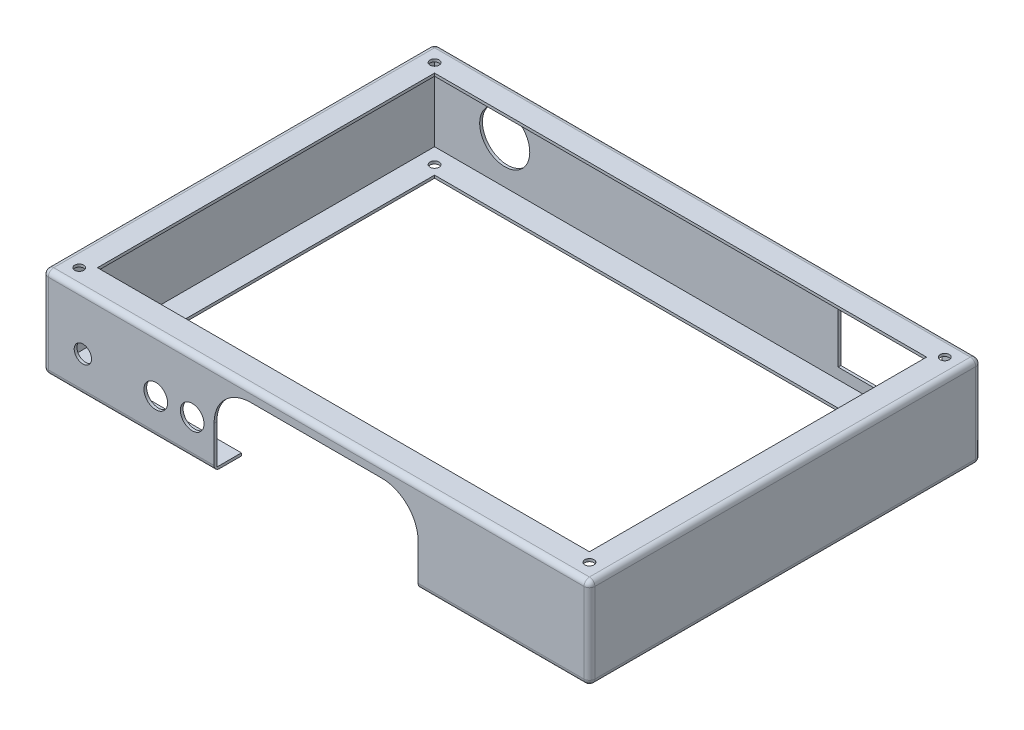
from build123d import *

# Parameters (mm, degrees)
ESQUISSE1_W                  = 300
ESQUISSE1_H                  = 215
BOSS_EXTRU_1_DEPTH           = 50
COQUE1_T                     = 1.5
CONG_2_R                     = 3
ESQUISSE2_R                  = 6.5
ESQUISSE2_R_2                = 4.75
ENL_V_MAT_EXTRU_1_DEPTH      = 15
ENL_V_MAT_EXTRU_2_DEPTH      = 373.458051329
ENL_V_MAT_EXTRU_2_DEPTH_BACK = 373.458051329
ESQUISSE3_W                  = 270
ESQUISSE3_H                  = 185
ENL_V_MAT_EXTRU_4_REACH      = 374.458
ESQUISSE5_W                  = 57
ESQUISSE5_H                  = 35
ENL_V_MAT_EXTRU_5_DEPTH      = 373.458051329
ENL_V_MAT_EXTRU_5_DEPTH_BACK = 373.458051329
ESQUISSE6_R                  = 2.5


with BuildPart() as part:
    # Esquisse1 → Boss.-Extru.1 (new body)
    with BuildSketch(Plane(origin=(0, 0, 0), x_dir=(1, 0, 0), z_dir=(0, 1, 0))):
        with Locations((150, 107.5)):
            Rectangle(ESQUISSE1_W, ESQUISSE1_H)
    extrude(amount=BOSS_EXTRU_1_DEPTH)

    # Coque1 (no face opened: a closed hollow body)
    add(offset(amount=-COQUE1_T, mode=Mode.PRIVATE), mode=Mode.SUBTRACT)

    # Cong_2
    cong_2_edges = [part.edges().sort_by_distance(p)[0] for p in [
        (300, 50, -107.5),
        (150, 50, -215),
        (0, 50, -107.5),
        (150, 0, -215),
        (300, 0, -107.5),
        (150, 0, 0),
        (0, 0, -107.5),
        (150, 50, 0),
        (0, 25, -215),
        (300, 25, -215),
        (300, 25, 0),
        (0, 25, 0),
    ]]
    fillet(cong_2_edges, radius=CONG_2_R)

    # Esquisse2 → Enl_v. mat.-Extru.1 (cut)
    with BuildSketch(Plane.XY):
        with Locations((82, 20)):
            Circle(ESQUISSE2_R)
        with Locations((22, 20)):
            Circle(ESQUISSE2_R_2)
        with Locations((62, 20)):
            Circle(ESQUISSE2_R)
        with BuildLine():
            Line((114, 43), (186, 43))
            ThreePointArc((186, 43), (200.142135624, 37.142135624), (206, 23))
            Line((206, 23), (206, 0))
            Line((206, 0), (94, 0))
            Line((94, 0), (94, 23))
            ThreePointArc((94, 23), (99.857864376, 37.142135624), (114, 43))
        make_face()
    extrude(amount=-ENL_V_MAT_EXTRU_1_DEPTH, mode=Mode.SUBTRACT)

    # Esquisse3 → Enl_v. mat.-Extru.2 (cut, two sides: drawn at the far end of the back side and taken through both)
    with BuildSketch(Plane(origin=(0, 50, 0), x_dir=(-1, 0, 0), z_dir=(0, 1, 0)).offset(-ENL_V_MAT_EXTRU_2_DEPTH_BACK)):
        with Locations((-150, -107.5)):
            Rectangle(ESQUISSE3_W, ESQUISSE3_H)
    extrude(amount=ENL_V_MAT_EXTRU_2_DEPTH + ENL_V_MAT_EXTRU_2_DEPTH_BACK, mode=Mode.SUBTRACT)

    # Esquisse5 → Enl_v. mat.-Extru.4 (cut, up to next)
    with BuildSketch(Plane(origin=(0, 0, -215), x_dir=(-1, 0, 0), z_dir=(0, 0, -1)), mode=Mode.PRIVATE) as enl_v_mat_extru_4_sk1:
        with Locations((-251.5, 25)):
            Rectangle(ESQUISSE5_W, ESQUISSE5_H)
    enl_v_mat_extru_4_tool1 = extrude(enl_v_mat_extru_4_sk1.sketch, amount=-ENL_V_MAT_EXTRU_4_REACH, mode=Mode.PRIVATE) & part.part
    # Esquisse5 → Enl_v. mat.-Extru.4 (cut, up to next)
    with BuildSketch(Plane(origin=(0, 0, -215), x_dir=(-1, 0, 0), z_dir=(0, 0, -1)), mode=Mode.PRIVATE) as enl_v_mat_extru_4_sk2:
        with BuildLine():
            Line((-41.5, 40), (-41.5, 38.667936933))
            ThreePointArc((-41.5, 38.667936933), (-40, 11.25), (-38.5, 38.667936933))
            Line((-38.5, 38.667936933), (-38.5, 40))
            Line((-38.5, 40), (-41.5, 40))
        make_face()
    enl_v_mat_extru_4_tool2 = extrude(enl_v_mat_extru_4_sk2.sketch, amount=-ENL_V_MAT_EXTRU_4_REACH, mode=Mode.PRIVATE) & part.part
    add(enl_v_mat_extru_4_tool1.solids().sort_by_distance((251.5, 25, -215))[0], mode=Mode.SUBTRACT)
    add(enl_v_mat_extru_4_tool2.solids().sort_by_distance((40, 25.092058, -215))[0], mode=Mode.SUBTRACT)

    # Esquisse6 → Enl_v. mat.-Extru.5 (cut, two sides: drawn at the far end of the back side and taken through both)
    with BuildSketch(Plane(origin=(0, 50, 0), x_dir=(1, 0, 0), z_dir=(0, 1, 0)).offset(-ENL_V_MAT_EXTRU_5_DEPTH_BACK)):
        with Locations(Location((290, 205, 0), (0, 0, 270))):
            Circle(ESQUISSE6_R)
        with Locations(Location((10, 205, 0), (0, 0, 270))):
            Circle(ESQUISSE6_R)
        with Locations(Location((10, 10, 0), (0, 0, 270))):
            Circle(ESQUISSE6_R)
        with Locations(Location((290, 10, 0), (0, 0, 270))):
            Circle(ESQUISSE6_R)
    extrude(amount=ENL_V_MAT_EXTRU_5_DEPTH + ENL_V_MAT_EXTRU_5_DEPTH_BACK, mode=Mode.SUBTRACT)


solid = part.part
